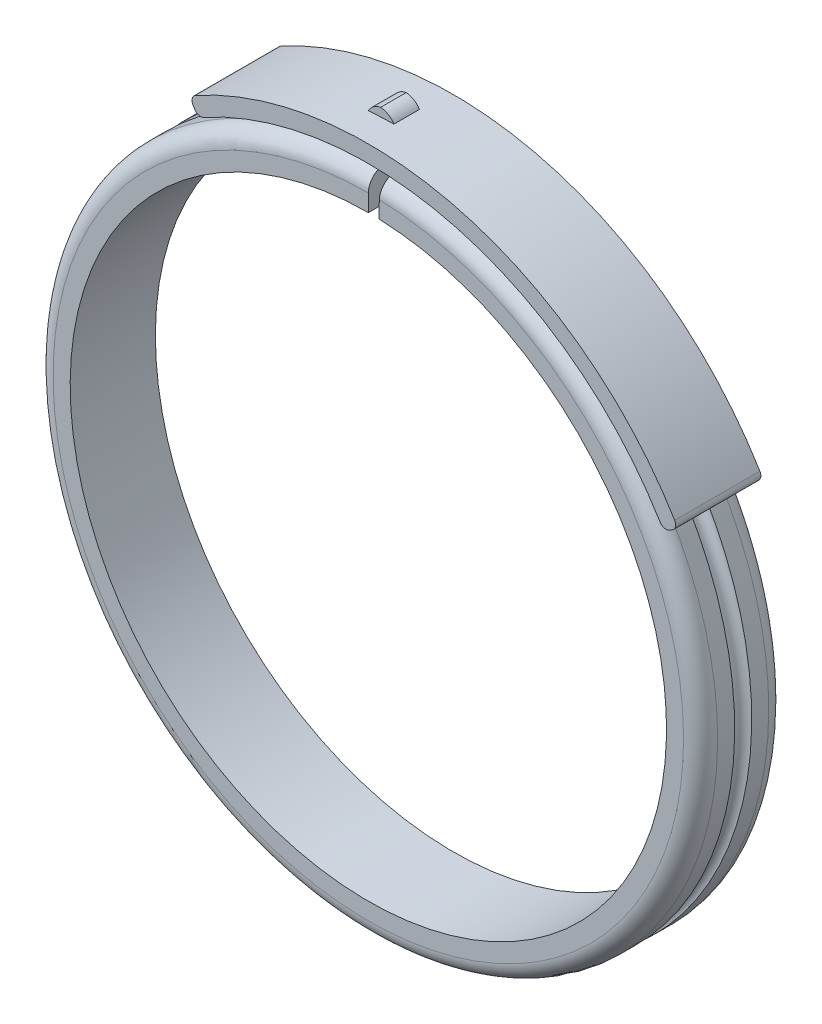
ISO-10303-21;
HEADER;
FILE_DESCRIPTION(('STEP AP214'),'2;1');
FILE_NAME('part.step','',(''),(''),'','','');
FILE_SCHEMA(('AUTOMOTIVE_DESIGN { 1 0 10303 214 1 1 1 1 }'));
ENDSEC;
DATA;
#1=APPLICATION_CONTEXT('core data for automotive mechanical design processes');
#2=APPLICATION_PROTOCOL_DEFINITION('international standard','automotive_design',2000,#1);
#3=PRODUCT_CONTEXT('',#1,'mechanical');
#4=PRODUCT('Part','Part','',(#3));
#5=PRODUCT_RELATED_PRODUCT_CATEGORY('part','',(#4));
#6=PRODUCT_DEFINITION_FORMATION('','',#4);
#7=PRODUCT_DEFINITION_CONTEXT('part definition',#1,'design');
#8=PRODUCT_DEFINITION('design','',#6,#7);
#9=PRODUCT_DEFINITION_SHAPE('','',#8);
#10=(LENGTH_UNIT() NAMED_UNIT(*) SI_UNIT(.MILLI.,.METRE.));
#11=(NAMED_UNIT(*) PLANE_ANGLE_UNIT() SI_UNIT($,.RADIAN.));
#12=(NAMED_UNIT(*) SI_UNIT($,.STERADIAN.) SOLID_ANGLE_UNIT());
#13=UNCERTAINTY_MEASURE_WITH_UNIT(LENGTH_MEASURE(1.E-05),#10,'distance_accuracy_value','');
#14=(GEOMETRIC_REPRESENTATION_CONTEXT(3) GLOBAL_UNCERTAINTY_ASSIGNED_CONTEXT((#13)) GLOBAL_UNIT_ASSIGNED_CONTEXT((#10,
#11,#12)) REPRESENTATION_CONTEXT('',''));
#15=CARTESIAN_POINT('',(0.,0.,0.));
#16=DIRECTION('',(0.,0.,1.));
#17=DIRECTION('',(1.,0.,0.));
#18=AXIS2_PLACEMENT_3D('',#15,#16,#17);
#19=CARTESIAN_POINT('',(0.,0.,10.));
#20=DIRECTION('',(0.,0.,-1.));
#21=DIRECTION('',(-1.,0.,0.));
#22=AXIS2_PLACEMENT_3D('',#19,#20,#21);
#23=CYLINDRICAL_SURFACE('',#22,39.);
#24=DIRECTION('',(0.,0.,-1.));
#25=VECTOR('',#24,1.);
#26=CARTESIAN_POINT('',(0.,39.,10.));
#27=LINE('',#26,#25);
#28=CARTESIAN_POINT('',(0.,39.,4.00000513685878));
#29=VERTEX_POINT('',#28);
#30=CARTESIAN_POINT('',(0.,39.,2.));
#31=VERTEX_POINT('',#30);
#32=EDGE_CURVE('E217',#29,#31,#27,.T.);
#33=ORIENTED_EDGE('',*,*,#32,.T.);
#34=CARTESIAN_POINT('',(0.,0.,2.));
#35=DIRECTION('',(0.,0.,1.));
#36=DIRECTION('',(1.,0.,0.));
#37=AXIS2_PLACEMENT_3D('',#34,#35,#36);
#38=CIRCLE('',#37,39.);
#39=CARTESIAN_POINT('',(1.36108037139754,38.9762422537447,2.));
#40=VERTEX_POINT('',#39);
#41=EDGE_CURVE('E210',#31,#40,#38,.T.);
#42=ORIENTED_EDGE('',*,*,#41,.T.);
#43=DIRECTION('',(0.,0.,-1.));
#44=VECTOR('',#43,1.);
#45=CARTESIAN_POINT('',(1.36108037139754,38.9762422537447,10.));
#46=LINE('',#45,#44);
#47=CARTESIAN_POINT('',(1.36108037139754,38.9762422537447,4.00000513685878));
#48=VERTEX_POINT('',#47);
#49=EDGE_CURVE('E243',#48,#40,#46,.T.);
#50=ORIENTED_EDGE('',*,*,#49,.F.);
#51=CARTESIAN_POINT('',(0.,0.,4.00000513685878));
#52=DIRECTION('',(0.,0.,1.));
#53=DIRECTION('',(1.,0.,0.));
#54=AXIS2_PLACEMENT_3D('',#51,#52,#53);
#55=CIRCLE('',#54,39.);
#56=CARTESIAN_POINT('',(-3.5,38.8426312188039,4.00000513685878));
#57=VERTEX_POINT('',#56);
#58=EDGE_CURVE('E223',#48,#57,#55,.F.);
#59=ORIENTED_EDGE('',*,*,#58,.T.);
#60=DIRECTION('',(0.,0.,-1.));
#61=VECTOR('',#60,1.);
#62=CARTESIAN_POINT('',(-3.5,38.8426312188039,10.));
#63=LINE('',#62,#61);
#64=CARTESIAN_POINT('',(-3.50000000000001,38.8426312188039,3.50000000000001));
#65=VERTEX_POINT('',#64);
#66=EDGE_CURVE('E255',#57,#65,#63,.T.);
#67=ORIENTED_EDGE('',*,*,#66,.T.);
#68=CARTESIAN_POINT('',(0.,0.,3.50000000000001));
#69=DIRECTION('',(0.,0.,1.));
#70=DIRECTION('',(1.,0.,0.));
#71=AXIS2_PLACEMENT_3D('',#68,#69,#70);
#72=CIRCLE('',#71,39.);
#73=CARTESIAN_POINT('',(-0.500000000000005,38.9967947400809,3.50000000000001));
#74=VERTEX_POINT('',#73);
#75=EDGE_CURVE('E247',#74,#65,#72,.T.);
#76=ORIENTED_EDGE('',*,*,#75,.F.);
#77=DIRECTION('',(0.,0.,-1.));
#78=VECTOR('',#77,1.);
#79=CARTESIAN_POINT('',(-0.500000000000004,38.9967947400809,10.));
#80=LINE('',#79,#78);
#81=CARTESIAN_POINT('',(-0.500000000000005,38.9967947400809,4.00000513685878));
#82=VERTEX_POINT('',#81);
#83=EDGE_CURVE('E220',#82,#74,#80,.T.);
#84=ORIENTED_EDGE('',*,*,#83,.F.);
#85=EDGE_CURVE('E205',#82,#29,#55,.F.);
#86=ORIENTED_EDGE('',*,*,#85,.T.);
#87=EDGE_LOOP('',(#33,#42,#50,#59,#67,#76,#84,#86));
#88=FACE_BOUND('',#87,.T.);
#89=ADVANCED_FACE('F34',(#88),#23,.T.);
#90=CARTESIAN_POINT('',(35.2735195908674,21.2889364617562,10.));
#91=DIRECTION('',(0.,0.,-1.));
#92=DIRECTION('',(-1.,0.,0.));
#93=AXIS2_PLACEMENT_3D('',#90,#91,#92);
#94=CYLINDRICAL_SURFACE('',#93,0.800000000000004);
#95=CARTESIAN_POINT('',(35.2735195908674,21.2889364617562,0.));
#96=DIRECTION('',(0.,0.,1.));
#97=DIRECTION('',(-1.,0.,0.));
#98=AXIS2_PLACEMENT_3D('',#95,#96,#97);
#99=CIRCLE('',#98,0.800000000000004);
#100=CARTESIAN_POINT('',(35.6735195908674,20.5961161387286,0.));
#101=VERTEX_POINT('',#100);
#102=CARTESIAN_POINT('',(35.9584423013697,21.7023138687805,0.));
#103=VERTEX_POINT('',#102);
#104=EDGE_CURVE('E282',#101,#103,#99,.T.);
#105=ORIENTED_EDGE('',*,*,#104,.T.);
#106=DIRECTION('',(0.,0.,-1.));
#107=VECTOR('',#106,1.);
#108=CARTESIAN_POINT('',(35.9584423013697,21.7023138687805,10.));
#109=LINE('',#108,#107);
#110=CARTESIAN_POINT('',(35.9584423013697,21.7023138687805,10.));
#111=VERTEX_POINT('',#110);
#112=EDGE_CURVE('E337',#111,#103,#109,.T.);
#113=ORIENTED_EDGE('',*,*,#112,.F.);
#114=CARTESIAN_POINT('',(35.2735195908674,21.2889364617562,10.));
#115=DIRECTION('',(0.,0.,1.));
#116=DIRECTION('',(-1.,0.,0.));
#117=AXIS2_PLACEMENT_3D('',#114,#115,#116);
#118=CIRCLE('',#117,0.800000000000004);
#119=CARTESIAN_POINT('',(35.6735195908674,20.5961161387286,10.));
#120=VERTEX_POINT('',#119);
#121=EDGE_CURVE('E283',#120,#111,#118,.T.);
#122=ORIENTED_EDGE('',*,*,#121,.F.);
#123=DIRECTION('',(0.,0.,-1.));
#124=VECTOR('',#123,1.);
#125=CARTESIAN_POINT('',(35.6735195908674,20.5961161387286,10.));
#126=LINE('',#125,#124);
#127=EDGE_CURVE('E301',#120,#101,#126,.T.);
#128=ORIENTED_EDGE('',*,*,#127,.T.);
#129=EDGE_LOOP('',(#105,#113,#122,#128));
#130=FACE_BOUND('',#129,.T.);
#131=ADVANCED_FACE('F444',(#130),#94,.T.);
#132=CARTESIAN_POINT('',(0.,0.,10.));
#133=DIRECTION('',(0.,0.,-1.));
#134=DIRECTION('',(-1.,0.,0.));
#135=AXIS2_PLACEMENT_3D('',#132,#133,#134);
#136=CYLINDRICAL_SURFACE('',#135,42.);
#137=CARTESIAN_POINT('',(0.,0.,3.50000000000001));
#138=DIRECTION('',(0.,0.,-1.));
#139=DIRECTION('',(-1.,0.,0.));
#140=AXIS2_PLACEMENT_3D('',#137,#138,#139);
#141=CIRCLE('',#140,42.);
#142=CARTESIAN_POINT('',(-3.5,41.8539126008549,3.50000000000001));
#143=VERTEX_POINT('',#142);
#144=CARTESIAN_POINT('',(-0.500000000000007,41.9970237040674,3.50000000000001));
#145=VERTEX_POINT('',#144);
#146=EDGE_CURVE('E274',#143,#145,#141,.T.);
#147=ORIENTED_EDGE('',*,*,#146,.T.);
#148=DIRECTION('',(0.,0.,-1.));
#149=VECTOR('',#148,1.);
#150=CARTESIAN_POINT('',(-0.500000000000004,41.9970237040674,10.));
#151=LINE('',#150,#149);
#152=CARTESIAN_POINT('',(-0.500000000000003,41.9970237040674,6.50000000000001));
#153=VERTEX_POINT('',#152);
#154=EDGE_CURVE('E280',#145,#153,#151,.F.);
#155=ORIENTED_EDGE('',*,*,#154,.T.);
#156=CARTESIAN_POINT('',(0.,0.,6.50000000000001));
#157=DIRECTION('',(0.,0.,1.));
#158=DIRECTION('',(1.,0.,0.));
#159=AXIS2_PLACEMENT_3D('',#156,#157,#158);
#160=CIRCLE('',#159,42.);
#161=CARTESIAN_POINT('',(-3.5,41.8539126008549,6.50000000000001));
#162=VERTEX_POINT('',#161);
#163=EDGE_CURVE('E277',#153,#162,#160,.T.);
#164=ORIENTED_EDGE('',*,*,#163,.T.);
#165=DIRECTION('',(0.,0.,-1.));
#166=VECTOR('',#165,1.);
#167=CARTESIAN_POINT('',(-3.5,41.8539126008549,10.));
#168=LINE('',#167,#166);
#169=EDGE_CURVE('E250',#143,#162,#168,.F.);
#170=ORIENTED_EDGE('',*,*,#169,.F.);
#171=EDGE_LOOP('',(#147,#155,#164,#170));
#172=FACE_BOUND('',#171,.T.);
#173=CARTESIAN_POINT('',(0.,0.,0.));
#174=DIRECTION('',(0.,0.,1.));
#175=DIRECTION('',(1.,0.,0.));
#176=AXIS2_PLACEMENT_3D('',#173,#174,#175);
#177=CIRCLE('',#176,42.);
#178=CARTESIAN_POINT('',(-20.2897675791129,36.7739762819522,0.));
#179=VERTEX_POINT('',#178);
#180=EDGE_CURVE('E304',#103,#179,#177,.T.);
#181=ORIENTED_EDGE('',*,*,#180,.T.);
#182=DIRECTION('',(0.,0.,-1.));
#183=VECTOR('',#182,1.);
#184=CARTESIAN_POINT('',(-20.2897675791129,36.7739762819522,10.));
#185=LINE('',#184,#183);
#186=CARTESIAN_POINT('',(-20.2897675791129,36.7739762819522,10.));
#187=VERTEX_POINT('',#186);
#188=EDGE_CURVE('E334',#187,#179,#185,.T.);
#189=ORIENTED_EDGE('',*,*,#188,.F.);
#190=CARTESIAN_POINT('',(0.,0.,10.));
#191=DIRECTION('',(0.,0.,1.));
#192=DIRECTION('',(1.,0.,0.));
#193=AXIS2_PLACEMENT_3D('',#190,#191,#192);
#194=CIRCLE('',#193,42.);
#195=EDGE_CURVE('E286',#111,#187,#194,.T.);
#196=ORIENTED_EDGE('',*,*,#195,.F.);
#197=ORIENTED_EDGE('',*,*,#112,.T.);
#198=EDGE_LOOP('',(#181,#189,#196,#197));
#199=FACE_BOUND('',#198,.T.);
#200=ADVANCED_FACE('F448',(#172,#199),#136,.T.);
#201=CARTESIAN_POINT('',(-19.9032958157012,36.0735195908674,10.));
#202=DIRECTION('',(0.,0.,-1.));
#203=DIRECTION('',(-1.,0.,0.));
#204=AXIS2_PLACEMENT_3D('',#201,#202,#203);
#205=CYLINDRICAL_SURFACE('',#204,0.799999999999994);
#206=CARTESIAN_POINT('',(-19.9032958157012,36.0735195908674,0.));
#207=DIRECTION('',(0.,0.,1.));
#208=DIRECTION('',(1.,0.,0.));
#209=AXIS2_PLACEMENT_3D('',#206,#207,#208);
#210=CIRCLE('',#209,0.799999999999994);
#211=CARTESIAN_POINT('',(-20.5961161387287,35.6735195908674,0.));
#212=VERTEX_POINT('',#211);
#213=EDGE_CURVE('E306',#179,#212,#210,.T.);
#214=ORIENTED_EDGE('',*,*,#213,.T.);
#215=DIRECTION('',(0.,0.,-1.));
#216=VECTOR('',#215,1.);
#217=CARTESIAN_POINT('',(-20.5961161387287,35.6735195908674,10.));
#218=LINE('',#217,#216);
#219=CARTESIAN_POINT('',(-20.5961161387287,35.6735195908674,10.));
#220=VERTEX_POINT('',#219);
#221=EDGE_CURVE('E331',#220,#212,#218,.T.);
#222=ORIENTED_EDGE('',*,*,#221,.F.);
#223=CARTESIAN_POINT('',(-19.9032958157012,36.0735195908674,10.));
#224=DIRECTION('',(0.,0.,1.));
#225=DIRECTION('',(1.,0.,0.));
#226=AXIS2_PLACEMENT_3D('',#223,#224,#225);
#227=CIRCLE('',#226,0.799999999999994);
#228=EDGE_CURVE('E289',#187,#220,#227,.T.);
#229=ORIENTED_EDGE('',*,*,#228,.F.);
#230=ORIENTED_EDGE('',*,*,#188,.T.);
#231=EDGE_LOOP('',(#214,#222,#229,#230));
#232=FACE_BOUND('',#231,.T.);
#233=ADVANCED_FACE('F454',(#232),#205,.T.);
#234=CARTESIAN_POINT('',(-20.3960780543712,35.3270434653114,10.));
#235=DIRECTION('',(0.866025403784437,0.500000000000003,0.));
#236=DIRECTION('',(-0.500000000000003,0.866025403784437,0.));
#237=AXIS2_PLACEMENT_3D('',#234,#235,#236);
#238=PLANE('',#237);
#239=DIRECTION('',(0.500000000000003,-0.866025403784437,0.));
#240=VECTOR('',#239,1.);
#241=CARTESIAN_POINT('',(-20.3960780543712,35.3270434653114,0.));
#242=LINE('',#241,#240);
#243=CARTESIAN_POINT('',(-20.3960780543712,35.3270434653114,0.));
#244=VERTEX_POINT('',#243);
#245=EDGE_CURVE('E308',#212,#244,#242,.T.);
#246=ORIENTED_EDGE('',*,*,#245,.T.);
#247=DIRECTION('',(0.,0.,-1.));
#248=VECTOR('',#247,1.);
#249=CARTESIAN_POINT('',(-20.3960780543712,35.3270434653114,10.));
#250=LINE('',#249,#248);
#251=CARTESIAN_POINT('',(-20.3960780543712,35.3270434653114,10.));
#252=VERTEX_POINT('',#251);
#253=EDGE_CURVE('E328',#252,#244,#250,.T.);
#254=ORIENTED_EDGE('',*,*,#253,.F.);
#255=DIRECTION('',(0.500000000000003,-0.866025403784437,0.));
#256=VECTOR('',#255,1.);
#257=CARTESIAN_POINT('',(-20.3960780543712,35.3270434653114,10.));
#258=LINE('',#257,#256);
#259=EDGE_CURVE('E291',#220,#252,#258,.T.);
#260=ORIENTED_EDGE('',*,*,#259,.F.);
#261=ORIENTED_EDGE('',*,*,#221,.T.);
#262=EDGE_LOOP('',(#246,#254,#260,#261));
#263=FACE_BOUND('',#262,.T.);
#264=ADVANCED_FACE('F647',(#263),#238,.F.);
#265=CARTESIAN_POINT('',(-19.7032577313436,35.7270434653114,10.));
#266=DIRECTION('',(0.,0.,-1.));
#267=DIRECTION('',(-1.,0.,0.));
#268=AXIS2_PLACEMENT_3D('',#265,#266,#267);
#269=CYLINDRICAL_SURFACE('',#268,0.800000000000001);
#270=CARTESIAN_POINT('',(-19.7032577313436,35.7270434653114,0.));
#271=DIRECTION('',(0.,0.,1.));
#272=DIRECTION('',(-1.,0.,0.));
#273=AXIS2_PLACEMENT_3D('',#270,#271,#272);
#274=CIRCLE('',#273,0.800000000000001);
#275=CARTESIAN_POINT('',(-19.3169193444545,35.0265132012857,0.));
#276=VERTEX_POINT('',#275);
#277=EDGE_CURVE('E310',#244,#276,#274,.T.);
#278=ORIENTED_EDGE('',*,*,#277,.T.);
#279=DIRECTION('',(0.,0.,-1.));
#280=VECTOR('',#279,1.);
#281=CARTESIAN_POINT('',(-19.3169193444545,35.0265132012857,10.));
#282=LINE('',#281,#280);
#283=CARTESIAN_POINT('',(-19.3169193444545,35.0265132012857,10.));
#284=VERTEX_POINT('',#283);
#285=EDGE_CURVE('E325',#284,#276,#282,.T.);
#286=ORIENTED_EDGE('',*,*,#285,.F.);
#287=CARTESIAN_POINT('',(-19.7032577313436,35.7270434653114,10.));
#288=DIRECTION('',(0.,0.,1.));
#289=DIRECTION('',(-1.,0.,0.));
#290=AXIS2_PLACEMENT_3D('',#287,#288,#289);
#291=CIRCLE('',#290,0.800000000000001);
#292=EDGE_CURVE('E293',#252,#284,#291,.T.);
#293=ORIENTED_EDGE('',*,*,#292,.F.);
#294=ORIENTED_EDGE('',*,*,#253,.T.);
#295=EDGE_LOOP('',(#278,#286,#293,#294));
#296=FACE_BOUND('',#295,.T.);
#297=ADVANCED_FACE('F601',(#296),#269,.T.);
#298=CARTESIAN_POINT('',(0.,0.,10.));
#299=DIRECTION('',(0.,0.,-1.));
#300=DIRECTION('',(-1.,0.,0.));
#301=AXIS2_PLACEMENT_3D('',#298,#299,#300);
#302=CYLINDRICAL_SURFACE('',#301,40.);
#303=CARTESIAN_POINT('',(0.,0.,6.50000000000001));
#304=DIRECTION('',(0.,0.,1.));
#305=DIRECTION('',(1.,0.,0.));
#306=AXIS2_PLACEMENT_3D('',#303,#304,#305);
#307=CIRCLE('',#306,40.);
#308=CARTESIAN_POINT('',(-3.5,39.8465807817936,6.50000000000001));
#309=VERTEX_POINT('',#308);
#310=CARTESIAN_POINT('',(-0.500000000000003,39.9968748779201,6.50000000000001));
#311=VERTEX_POINT('',#310);
#312=EDGE_CURVE('E345',#309,#311,#307,.F.);
#313=ORIENTED_EDGE('',*,*,#312,.T.);
#314=DIRECTION('',(0.,0.,-1.));
#315=VECTOR('',#314,1.);
#316=CARTESIAN_POINT('',(-0.500000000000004,39.9968748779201,10.));
#317=LINE('',#316,#315);
#318=CARTESIAN_POINT('',(-0.500000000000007,39.9968748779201,3.50000000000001));
#319=VERTEX_POINT('',#318);
#320=EDGE_CURVE('E347',#311,#319,#317,.T.);
#321=ORIENTED_EDGE('',*,*,#320,.T.);
#322=CARTESIAN_POINT('',(0.,0.,3.50000000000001));
#323=DIRECTION('',(0.,0.,-1.));
#324=DIRECTION('',(-1.,0.,0.));
#325=AXIS2_PLACEMENT_3D('',#322,#323,#324);
#326=CIRCLE('',#325,40.);
#327=CARTESIAN_POINT('',(-3.5,39.8465807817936,3.50000000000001));
#328=VERTEX_POINT('',#327);
#329=EDGE_CURVE('E343',#319,#328,#326,.F.);
#330=ORIENTED_EDGE('',*,*,#329,.T.);
#331=DIRECTION('',(0.,0.,-1.));
#332=VECTOR('',#331,1.);
#333=CARTESIAN_POINT('',(-3.5,39.8465807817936,10.));
#334=LINE('',#333,#332);
#335=EDGE_CURVE('E340',#309,#328,#334,.T.);
#336=ORIENTED_EDGE('',*,*,#335,.F.);
#337=EDGE_LOOP('',(#313,#321,#330,#336));
#338=FACE_BOUND('',#337,.T.);
#339=CARTESIAN_POINT('',(0.,0.,0.));
#340=DIRECTION('',(0.,0.,-1.));
#341=DIRECTION('',(1.,0.,0.));
#342=AXIS2_PLACEMENT_3D('',#339,#340,#341);
#343=CIRCLE('',#342,40.);
#344=CARTESIAN_POINT('',(34.2421994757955,20.6753905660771,0.));
#345=VERTEX_POINT('',#344);
#346=EDGE_CURVE('E312',#276,#345,#343,.T.);
#347=ORIENTED_EDGE('',*,*,#346,.T.);
#348=DIRECTION('',(0.,0.,-1.));
#349=VECTOR('',#348,1.);
#350=CARTESIAN_POINT('',(34.2421994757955,20.6753905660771,10.));
#351=LINE('',#350,#349);
#352=CARTESIAN_POINT('',(34.2421994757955,20.6753905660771,10.));
#353=VERTEX_POINT('',#352);
#354=EDGE_CURVE('E322',#353,#345,#351,.T.);
#355=ORIENTED_EDGE('',*,*,#354,.F.);
#356=CARTESIAN_POINT('',(0.,0.,10.));
#357=DIRECTION('',(0.,0.,-1.));
#358=DIRECTION('',(1.,0.,0.));
#359=AXIS2_PLACEMENT_3D('',#356,#357,#358);
#360=CIRCLE('',#359,40.);
#361=EDGE_CURVE('E295',#284,#353,#360,.T.);
#362=ORIENTED_EDGE('',*,*,#361,.F.);
#363=ORIENTED_EDGE('',*,*,#285,.T.);
#364=EDGE_LOOP('',(#347,#355,#362,#363));
#365=FACE_BOUND('',#364,.T.);
#366=ADVANCED_FACE('F595',(#338,#365),#302,.F.);
#367=CARTESIAN_POINT('',(34.9270434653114,21.0888983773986,10.));
#368=DIRECTION('',(0.,0.,-1.));
#369=DIRECTION('',(-1.,0.,0.));
#370=AXIS2_PLACEMENT_3D('',#367,#368,#369);
#371=CYLINDRICAL_SURFACE('',#370,0.800000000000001);
#372=CARTESIAN_POINT('',(34.9270434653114,21.0888983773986,0.));
#373=DIRECTION('',(0.,0.,1.));
#374=DIRECTION('',(1.,0.,0.));
#375=AXIS2_PLACEMENT_3D('',#372,#373,#374);
#376=CIRCLE('',#375,0.800000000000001);
#377=CARTESIAN_POINT('',(35.3270434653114,20.3960780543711,0.));
#378=VERTEX_POINT('',#377);
#379=EDGE_CURVE('E314',#345,#378,#376,.T.);
#380=ORIENTED_EDGE('',*,*,#379,.T.);
#381=DIRECTION('',(0.,0.,-1.));
#382=VECTOR('',#381,1.);
#383=CARTESIAN_POINT('',(35.3270434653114,20.3960780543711,10.));
#384=LINE('',#383,#382);
#385=CARTESIAN_POINT('',(35.3270434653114,20.3960780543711,10.));
#386=VERTEX_POINT('',#385);
#387=EDGE_CURVE('E319',#386,#378,#384,.T.);
#388=ORIENTED_EDGE('',*,*,#387,.F.);
#389=CARTESIAN_POINT('',(34.9270434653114,21.0888983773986,10.));
#390=DIRECTION('',(0.,0.,1.));
#391=DIRECTION('',(1.,0.,0.));
#392=AXIS2_PLACEMENT_3D('',#389,#390,#391);
#393=CIRCLE('',#392,0.800000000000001);
#394=EDGE_CURVE('E297',#353,#386,#393,.T.);
#395=ORIENTED_EDGE('',*,*,#394,.F.);
#396=ORIENTED_EDGE('',*,*,#354,.T.);
#397=EDGE_LOOP('',(#380,#388,#395,#396));
#398=FACE_BOUND('',#397,.T.);
#399=ADVANCED_FACE('F600',(#398),#371,.T.);
#400=CARTESIAN_POINT('',(35.3270434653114,20.3960780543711,10.));
#401=DIRECTION('',(-0.499999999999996,0.866025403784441,0.));
#402=DIRECTION('',(-0.866025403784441,-0.499999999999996,0.));
#403=AXIS2_PLACEMENT_3D('',#400,#401,#402);
#404=PLANE('',#403);
#405=DIRECTION('',(0.866025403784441,0.499999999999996,0.));
#406=VECTOR('',#405,1.);
#407=CARTESIAN_POINT('',(35.3270434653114,20.3960780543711,0.));
#408=LINE('',#407,#406);
#409=EDGE_CURVE('E287',#378,#101,#408,.T.);
#410=ORIENTED_EDGE('',*,*,#409,.T.);
#411=ORIENTED_EDGE('',*,*,#127,.F.);
#412=DIRECTION('',(0.866025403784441,0.499999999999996,0.));
#413=VECTOR('',#412,1.);
#414=CARTESIAN_POINT('',(35.3270434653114,20.3960780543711,10.));
#415=LINE('',#414,#413);
#416=EDGE_CURVE('E299',#386,#120,#415,.T.);
#417=ORIENTED_EDGE('',*,*,#416,.F.);
#418=ORIENTED_EDGE('',*,*,#387,.T.);
#419=EDGE_LOOP('',(#410,#411,#417,#418));
#420=FACE_BOUND('',#419,.T.);
#421=ADVANCED_FACE('F623',(#420),#404,.F.);
#422=CARTESIAN_POINT('',(35.2735195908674,21.2889364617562,10.));
#423=DIRECTION('',(0.,0.,-1.));
#424=DIRECTION('',(-1.,0.,0.));
#425=AXIS2_PLACEMENT_3D('',#422,#423,#424);
#426=PLANE('',#425);
#427=ORIENTED_EDGE('',*,*,#121,.T.);
#428=ORIENTED_EDGE('',*,*,#195,.T.);
#429=ORIENTED_EDGE('',*,*,#228,.T.);
#430=ORIENTED_EDGE('',*,*,#259,.T.);
#431=ORIENTED_EDGE('',*,*,#292,.T.);
#432=ORIENTED_EDGE('',*,*,#361,.T.);
#433=ORIENTED_EDGE('',*,*,#394,.T.);
#434=ORIENTED_EDGE('',*,*,#416,.T.);
#435=EDGE_LOOP('',(#427,#428,#429,#430,#431,#432,#433,#434));
#436=FACE_BOUND('',#435,.T.);
#437=ADVANCED_FACE('F613',(#436),#426,.F.);
#438=CARTESIAN_POINT('',(35.2735195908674,21.2889364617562,0.));
#439=DIRECTION('',(0.,0.,-1.));
#440=DIRECTION('',(-1.,0.,0.));
#441=AXIS2_PLACEMENT_3D('',#438,#439,#440);
#442=PLANE('',#441);
#443=ORIENTED_EDGE('',*,*,#104,.F.);
#444=ORIENTED_EDGE('',*,*,#409,.F.);
#445=ORIENTED_EDGE('',*,*,#379,.F.);
#446=ORIENTED_EDGE('',*,*,#346,.F.);
#447=ORIENTED_EDGE('',*,*,#277,.F.);
#448=ORIENTED_EDGE('',*,*,#245,.F.);
#449=ORIENTED_EDGE('',*,*,#213,.F.);
#450=ORIENTED_EDGE('',*,*,#180,.F.);
#451=EDGE_LOOP('',(#443,#444,#445,#446,#447,#448,#449,#450));
#452=FACE_BOUND('',#451,.T.);
#453=ADVANCED_FACE('F538',(#452),#442,.T.);
#454=CARTESIAN_POINT('',(-3.5,38.8426312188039,10.));
#455=DIRECTION('',(1.,0.,0.));
#456=DIRECTION('',(0.,0.,-1.));
#457=AXIS2_PLACEMENT_3D('',#454,#455,#456);
#458=PLANE('',#457);
#459=ORIENTED_EDGE('',*,*,#66,.F.);
#460=CARTESIAN_POINT('',(-3.5,39.1600785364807,4.05237393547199));
#461=CARTESIAN_POINT('',(-3.5,39.2135485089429,4.0703261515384));
#462=CARTESIAN_POINT('',(-3.5,39.2655446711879,4.0927950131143));
#463=CARTESIAN_POINT('',(-3.5,39.3650747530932,4.14615448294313));
#464=CARTESIAN_POINT('',(-3.5,39.4126033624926,4.17705494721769));
#465=CARTESIAN_POINT('',(-3.5,39.5017810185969,4.24639771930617));
#466=CARTESIAN_POINT('',(-3.5,39.5434319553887,4.28483759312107));
#467=CARTESIAN_POINT('',(-3.5,39.6196556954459,4.36817204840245));
#468=CARTESIAN_POINT('',(-3.5,39.6542302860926,4.41306499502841));
#469=CARTESIAN_POINT('',(-3.5,39.715232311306,4.50791459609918));
#470=CARTESIAN_POINT('',(-3.5,39.7416809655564,4.55785760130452));
#471=CARTESIAN_POINT('',(-3.5,39.7857856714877,4.66148803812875));
#472=CARTESIAN_POINT('',(-3.5,39.8034415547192,4.71517554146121));
#473=CARTESIAN_POINT('',(-3.5,39.8293989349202,4.82456944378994));
#474=CARTESIAN_POINT('',(-3.5,39.8377326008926,4.88026821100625));
#475=CARTESIAN_POINT('',(-3.5,39.8449125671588,4.99227351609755));
#476=CARTESIAN_POINT('',(-3.5,39.8437590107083,5.04858004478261));
#477=CARTESIAN_POINT('',(-3.5,39.8320086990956,5.16009975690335));
#478=CARTESIAN_POINT('',(-3.5,39.8214282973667,5.21531466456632));
#479=CARTESIAN_POINT('',(-3.5,39.7911537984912,5.32318609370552));
#480=CARTESIAN_POINT('',(-3.5,39.7714597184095,5.37584261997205));
#481=CARTESIAN_POINT('',(-3.5,39.7235105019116,5.47714445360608));
#482=CARTESIAN_POINT('',(-3.5,39.6952496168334,5.52578703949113));
#483=CARTESIAN_POINT('',(-3.5,39.6309840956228,5.617654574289));
#484=CARTESIAN_POINT('',(-3.5,39.5949793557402,5.66087945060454));
#485=CARTESIAN_POINT('',(-3.5,39.5161437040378,5.7408171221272));
#486=CARTESIAN_POINT('',(-3.5,39.4732939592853,5.77751134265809));
#487=CARTESIAN_POINT('',(-3.5,39.3820620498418,5.84321756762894));
#488=CARTESIAN_POINT('',(-3.5,39.3336797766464,5.87222942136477));
#489=CARTESIAN_POINT('',(-3.5,39.2325596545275,5.92186360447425));
#490=CARTESIAN_POINT('',(-3.5,39.1798059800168,5.9424536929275));
#491=CARTESIAN_POINT('',(-3.5,39.0715971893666,5.97451709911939));
#492=CARTESIAN_POINT('',(-3.5,39.0161420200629,5.98599023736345));
#493=CARTESIAN_POINT('',(-3.5,38.9039138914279,5.99952618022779));
#494=CARTESIAN_POINT('',(-3.5,38.8471372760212,6.00155868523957));
#495=CARTESIAN_POINT('',(-3.5,38.734046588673,5.99607564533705));
#496=CARTESIAN_POINT('',(-3.5,38.677732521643,5.9885599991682));
#497=CARTESIAN_POINT('',(-3.5,38.5670952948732,5.96417432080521));
#498=CARTESIAN_POINT('',(-3.5,38.5127746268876,5.94729297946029));
#499=CARTESIAN_POINT('',(-3.5,38.4077441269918,5.90463776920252));
#500=CARTESIAN_POINT('',(-3.5,38.3570342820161,5.87886393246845));
#501=CARTESIAN_POINT('',(-3.5,38.26074645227,5.81918681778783));
#502=CARTESIAN_POINT('',(-3.5,38.2151613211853,5.78529507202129));
#503=CARTESIAN_POINT('',(-3.5,38.1303532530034,5.71031475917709));
#504=CARTESIAN_POINT('',(-3.5,38.0911302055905,5.66922631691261));
#505=CARTESIAN_POINT('',(-3.5,38.0203093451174,5.58117097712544));
#506=CARTESIAN_POINT('',(-3.5,37.9886852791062,5.53422519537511));
#507=CARTESIAN_POINT('',(-3.5,37.933805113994,5.43567355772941));
#508=CARTESIAN_POINT('',(-3.5,37.9105488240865,5.38406780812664));
#509=CARTESIAN_POINT('',(-3.5,37.8731611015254,5.27788601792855));
#510=CARTESIAN_POINT('',(-3.5,37.8589930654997,5.22332286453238));
#511=CARTESIAN_POINT('',(-3.5,37.840046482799,5.11259026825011));
#512=CARTESIAN_POINT('',(-3.5,37.8352677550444,5.05642085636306));
#513=CARTESIAN_POINT('',(-3.5,37.8352394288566,4.9442332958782));
#514=CARTESIAN_POINT('',(-3.5,37.8399639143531,4.88821515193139));
#515=CARTESIAN_POINT('',(-3.5,37.8587521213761,4.77776796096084));
#516=CARTESIAN_POINT('',(-3.5,37.8728158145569,4.72333890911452));
#517=CARTESIAN_POINT('',(-3.5,37.9098715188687,4.61761760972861));
#518=CARTESIAN_POINT('',(-3.5,37.9328625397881,4.56632501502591));
#519=CARTESIAN_POINT('',(-3.5,37.9871085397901,4.46831415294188));
#520=CARTESIAN_POINT('',(-3.5,38.0183636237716,4.42159594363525));
#521=CARTESIAN_POINT('',(-3.5,38.0883311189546,4.3339279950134));
#522=CARTESIAN_POINT('',(-3.5,38.1270624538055,4.29299336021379));
#523=CARTESIAN_POINT('',(-3.5,38.2108219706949,4.21817740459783));
#524=CARTESIAN_POINT('',(-3.5,38.2558500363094,4.18429595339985));
#525=CARTESIAN_POINT('',(-3.5,38.3511130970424,4.12440479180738));
#526=CARTESIAN_POINT('',(-3.5,38.4013676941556,4.09842626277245));
#527=CARTESIAN_POINT('',(-3.5,38.5055278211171,4.05523381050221));
#528=CARTESIAN_POINT('',(-3.5,38.5594343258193,4.03802223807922));
#529=CARTESIAN_POINT('',(-3.5,38.6695855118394,4.01279492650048));
#530=CARTESIAN_POINT('',(-3.5,38.7258388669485,4.00481714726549));
#531=CARTESIAN_POINT('',(-3.5,38.8388405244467,3.99841654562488));
#532=CARTESIAN_POINT('',(-3.5,38.8955881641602,3.9999824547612));
#533=CARTESIAN_POINT('',(-3.5,38.9871788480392,4.01025081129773));
#534=CARTESIAN_POINT('',(-3.5,39.0223660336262,4.01610175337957));
#535=CARTESIAN_POINT('',(-3.5,39.0919244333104,4.03149211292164));
#536=CARTESIAN_POINT('',(-3.5,39.1262956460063,4.04103153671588));
#537=CARTESIAN_POINT('',(-3.5,39.1600785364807,4.05237393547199));
#538=B_SPLINE_CURVE_WITH_KNOTS('',3,(#460,#461,#462,#463,#464,#465,#466,#467,#468,#469,#470,
#471,#472,#473,#474,#475,#476,#477,#478,#479,#480,#481,#482,#483,#484,#485,#486,#487,#488,#489,
#490,#491,#492,#493,#494,#495,#496,#497,#498,#499,#500,#501,#502,#503,#504,#505,#506,#507,#508,
#509,#510,#511,#512,#513,#514,#515,#516,#517,#518,#519,#520,#521,#522,#523,#524,#525,#526,#527,
#528,#529,#530,#531,#532,#533,#534,#535,#536,#537),.UNSPECIFIED.,.T.,.F.,(4,2,2,2,2,2,2,2,2,2,2,
2,2,2,2,2,2,2,2,2,2,2,2,2,2,2,2,2,2,2,2,2,2,2,2,2,2,2,4),(0.,0.169080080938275,
0.338358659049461,0.507582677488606,0.676763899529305,0.845499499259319,1.01423833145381,
1.18239306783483,1.35054526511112,1.51840632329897,1.68626706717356,1.85424070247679,
2.02221658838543,2.1906628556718,2.35911242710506,2.52820096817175,2.69729283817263,
2.8669270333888,3.036563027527,3.20640430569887,3.3762449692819,3.54584577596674,
3.71544364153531,3.88444687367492,4.0534462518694,4.22176063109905,4.39007176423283,
4.55792452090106,4.72577676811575,4.89361040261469,5.06144616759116,5.22971245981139,
5.3979756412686,5.56689435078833,5.73585833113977,5.90551447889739,6.07497034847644,
6.18179673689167,6.2886233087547),.UNSPECIFIED.);
#539=CARTESIAN_POINT('',(-3.5,38.8426312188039,5.99999486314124));
#540=VERTEX_POINT('',#539);
#541=EDGE_CURVE('E359',#57,#540,#538,.T.);
#542=ORIENTED_EDGE('',*,*,#541,.T.);
#543=CARTESIAN_POINT('',(-3.5,38.8426312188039,6.50000000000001));
#544=VERTEX_POINT('',#543);
#545=EDGE_CURVE('E252',#544,#540,#63,.T.);
#546=ORIENTED_EDGE('',*,*,#545,.F.);
#547=DIRECTION('',(0.,1.,0.));
#548=VECTOR('',#547,1.);
#549=CARTESIAN_POINT('',(-3.5,38.8426312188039,6.50000000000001));
#550=LINE('',#549,#548);
#551=EDGE_CURVE('E259',#544,#309,#550,.T.);
#552=ORIENTED_EDGE('',*,*,#551,.T.);
#553=ORIENTED_EDGE('',*,*,#335,.T.);
#554=DIRECTION('',(0.,1.,0.));
#555=VECTOR('',#554,1.);
#556=CARTESIAN_POINT('',(-3.5,38.8426312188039,3.50000000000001));
#557=LINE('',#556,#555);
#558=EDGE_CURVE('E251',#65,#328,#557,.T.);
#559=ORIENTED_EDGE('',*,*,#558,.F.);
#560=EDGE_LOOP('',(#459,#542,#546,#552,#553,#559));
#561=FACE_BOUND('',#560,.T.);
#562=ADVANCED_FACE('F534',(#561),#458,.F.);
#563=CARTESIAN_POINT('',(-3.5,38.8426312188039,3.50000000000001));
#564=DIRECTION('',(0.,0.,-1.));
#565=DIRECTION('',(-1.,0.,0.));
#566=AXIS2_PLACEMENT_3D('',#563,#564,#565);
#567=PLANE('',#566);
#568=ORIENTED_EDGE('',*,*,#329,.F.);
#569=DIRECTION('',(0.,1.,0.));
#570=VECTOR('',#569,1.);
#571=CARTESIAN_POINT('',(-0.500000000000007,38.9967947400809,3.50000000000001));
#572=LINE('',#571,#570);
#573=EDGE_CURVE('E263',#74,#319,#572,.T.);
#574=ORIENTED_EDGE('',*,*,#573,.F.);
#575=ORIENTED_EDGE('',*,*,#75,.T.);
#576=ORIENTED_EDGE('',*,*,#558,.T.);
#577=EDGE_LOOP('',(#568,#574,#575,#576));
#578=FACE_BOUND('',#577,.T.);
#579=ADVANCED_FACE('F442',(#578),#567,.T.);
#580=CARTESIAN_POINT('',(-0.500000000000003,38.9967947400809,6.50000000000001));
#581=DIRECTION('',(0.,0.,1.));
#582=DIRECTION('',(1.,0.,0.));
#583=AXIS2_PLACEMENT_3D('',#580,#581,#582);
#584=PLANE('',#583);
#585=ORIENTED_EDGE('',*,*,#312,.F.);
#586=ORIENTED_EDGE('',*,*,#551,.F.);
#587=CARTESIAN_POINT('',(0.,0.,6.50000000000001));
#588=DIRECTION('',(0.,0.,-1.));
#589=DIRECTION('',(-1.,0.,0.));
#590=AXIS2_PLACEMENT_3D('',#587,#588,#589);
#591=CIRCLE('',#590,39.);
#592=CARTESIAN_POINT('',(-0.500000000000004,38.9967947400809,6.50000000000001));
#593=VERTEX_POINT('',#592);
#594=EDGE_CURVE('E256',#544,#593,#591,.T.);
#595=ORIENTED_EDGE('',*,*,#594,.T.);
#596=DIRECTION('',(0.,1.,0.));
#597=VECTOR('',#596,1.);
#598=CARTESIAN_POINT('',(-0.500000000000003,38.9967947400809,6.50000000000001));
#599=LINE('',#598,#597);
#600=EDGE_CURVE('E246',#593,#311,#599,.T.);
#601=ORIENTED_EDGE('',*,*,#600,.T.);
#602=EDGE_LOOP('',(#585,#586,#595,#601));
#603=FACE_BOUND('',#602,.T.);
#604=ADVANCED_FACE('F525',(#603),#584,.T.);
#605=CARTESIAN_POINT('',(-0.500000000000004,38.9967947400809,10.));
#606=DIRECTION('',(1.,0.,0.));
#607=DIRECTION('',(0.,0.,-1.));
#608=AXIS2_PLACEMENT_3D('',#605,#606,#607);
#609=PLANE('',#608);
#610=CARTESIAN_POINT('',(-0.500000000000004,39.3134523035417,4.0525274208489));
#611=CARTESIAN_POINT('',(-0.500000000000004,39.3666763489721,4.07049536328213));
#612=CARTESIAN_POINT('',(-0.500000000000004,39.418421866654,4.09297090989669));
#613=CARTESIAN_POINT('',(-0.500000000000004,39.5174476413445,4.14631007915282));
#614=CARTESIAN_POINT('',(-0.500000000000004,39.5647224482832,4.1771837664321));
#615=CARTESIAN_POINT('',(-0.500000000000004,39.6533981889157,4.24641954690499));
#616=CARTESIAN_POINT('',(-0.500000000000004,39.6948018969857,4.2847780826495));
#617=CARTESIAN_POINT('',(-0.500000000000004,39.7705695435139,4.36789198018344));
#618=CARTESIAN_POINT('',(-0.500000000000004,39.8049352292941,4.41264574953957));
#619=CARTESIAN_POINT('',(-0.500000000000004,39.8656674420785,4.50728996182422));
#620=CARTESIAN_POINT('',(-0.500000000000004,39.8920335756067,4.55718065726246));
#621=CARTESIAN_POINT('',(-0.500000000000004,39.9360159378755,4.66068257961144));
#622=CARTESIAN_POINT('',(-0.500000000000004,39.9536318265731,4.714293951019));
#623=CARTESIAN_POINT('',(-0.500000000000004,39.9796107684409,4.8237085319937));
#624=CARTESIAN_POINT('',(-0.500000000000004,39.9879746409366,4.87951154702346));
#625=CARTESIAN_POINT('',(-0.500000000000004,39.9952147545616,4.99172958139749));
#626=CARTESIAN_POINT('',(-0.500000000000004,39.9940910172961,5.04814459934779));
#627=CARTESIAN_POINT('',(-0.500000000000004,39.982388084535,5.15998330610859));
#628=CARTESIAN_POINT('',(-0.500000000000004,39.9718092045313,5.21540702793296));
#629=CARTESIAN_POINT('',(-0.500000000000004,39.9414968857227,5.32369170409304));
#630=CARTESIAN_POINT('',(-0.500000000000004,39.9217634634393,5.37655266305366));
#631=CARTESIAN_POINT('',(-0.500000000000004,39.8737021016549,5.47821222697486));
#632=CARTESIAN_POINT('',(-0.500000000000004,39.8453740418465,5.52701077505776));
#633=CARTESIAN_POINT('',(-0.500000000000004,39.7809278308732,5.61915977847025));
#634=CARTESIAN_POINT('',(-0.500000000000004,39.7448096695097,5.66251022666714));
#635=CARTESIAN_POINT('',(-0.500000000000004,39.665806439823,5.7425350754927));
#636=CARTESIAN_POINT('',(-0.500000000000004,39.6229209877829,5.77920909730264));
#637=CARTESIAN_POINT('',(-0.500000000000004,39.5316021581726,5.84483740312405));
#638=CARTESIAN_POINT('',(-0.500000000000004,39.4831687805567,5.87379168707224));
#639=CARTESIAN_POINT('',(-0.500000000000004,39.3821249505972,5.92316097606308));
#640=CARTESIAN_POINT('',(-0.500000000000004,39.3295141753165,5.94357532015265));
#641=CARTESIAN_POINT('',(-0.500000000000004,39.2216122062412,5.97528231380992));
#642=CARTESIAN_POINT('',(-0.500000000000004,39.166321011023,5.98657495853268));
#643=CARTESIAN_POINT('',(-0.500000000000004,39.0546239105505,5.99971862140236));
#644=CARTESIAN_POINT('',(-0.500000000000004,38.9982179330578,6.00156902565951));
#645=CARTESIAN_POINT('',(-0.500000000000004,38.8858958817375,5.99577406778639));
#646=CARTESIAN_POINT('',(-0.500000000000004,38.8299798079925,5.98812870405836));
#647=CARTESIAN_POINT('',(-0.500000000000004,38.7202234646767,5.96355884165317));
#648=CARTESIAN_POINT('',(-0.500000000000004,38.6663832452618,5.94663411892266));
#649=CARTESIAN_POINT('',(-0.500000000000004,38.562308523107,5.90398563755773));
#650=CARTESIAN_POINT('',(-0.500000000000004,38.5120740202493,5.8782618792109));
#651=CARTESIAN_POINT('',(-0.500000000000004,38.4166384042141,5.81874619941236));
#652=CARTESIAN_POINT('',(-0.500000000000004,38.3714371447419,5.78495451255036));
#653=CARTESIAN_POINT('',(-0.500000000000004,38.2873498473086,5.71026162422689));
#654=CARTESIAN_POINT('',(-0.500000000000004,38.2484638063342,5.66936042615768));
#655=CARTESIAN_POINT('',(-0.500000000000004,38.1781138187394,5.58161266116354));
#656=CARTESIAN_POINT('',(-0.500000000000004,38.1466493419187,5.5347665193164));
#657=CARTESIAN_POINT('',(-0.500000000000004,38.0920325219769,5.43645634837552));
#658=CARTESIAN_POINT('',(-0.500000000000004,38.0688801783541,5.38499231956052));
#659=CARTESIAN_POINT('',(-0.500000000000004,38.0315468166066,5.27891183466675));
#660=CARTESIAN_POINT('',(-0.500000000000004,38.0173650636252,5.22429563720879));
#661=CARTESIAN_POINT('',(-0.500000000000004,37.9983727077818,5.11345753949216));
#662=CARTESIAN_POINT('',(-0.500000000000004,37.9935620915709,5.05723564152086));
#663=CARTESIAN_POINT('',(-0.500000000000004,37.9934486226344,4.9447853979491));
#664=CARTESIAN_POINT('',(-0.500000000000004,37.9981452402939,4.88855705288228));
#665=CARTESIAN_POINT('',(-0.500000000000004,38.0169117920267,4.77768685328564));
#666=CARTESIAN_POINT('',(-0.500000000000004,38.0309817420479,4.72304500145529));
#667=CARTESIAN_POINT('',(-0.500000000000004,38.0680952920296,4.6168991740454));
#668=CARTESIAN_POINT('',(-0.500000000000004,38.09113885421,4.56539518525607));
#669=CARTESIAN_POINT('',(-0.500000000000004,38.1455453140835,4.46698653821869));
#670=CARTESIAN_POINT('',(-0.500000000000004,38.1769082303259,4.42008189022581));
#671=CARTESIAN_POINT('',(-0.500000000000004,38.2470653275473,4.3322000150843));
#672=CARTESIAN_POINT('',(-0.500000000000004,38.2858600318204,4.2912232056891));
#673=CARTESIAN_POINT('',(-0.500000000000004,38.3697763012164,4.21636526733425));
#674=CARTESIAN_POINT('',(-0.500000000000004,38.4148976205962,4.18248386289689));
#675=CARTESIAN_POINT('',(-0.500000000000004,38.510185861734,4.12277653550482));
#676=CARTESIAN_POINT('',(-0.500000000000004,38.5603526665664,4.09695042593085));
#677=CARTESIAN_POINT('',(-0.500000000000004,38.664323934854,4.05408027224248));
#678=CARTESIAN_POINT('',(-0.500000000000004,38.7181293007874,4.03703841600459));
#679=CARTESIAN_POINT('',(-0.500000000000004,38.8278621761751,4.01222165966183));
#680=CARTESIAN_POINT('',(-0.500000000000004,38.883790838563,4.00445187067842));
#681=CARTESIAN_POINT('',(-0.500000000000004,38.9961119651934,3.99842673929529));
#682=CARTESIAN_POINT('',(-0.500000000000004,39.0525037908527,4.00015996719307));
#683=CARTESIAN_POINT('',(-0.500000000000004,39.1431913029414,4.01062714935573));
#684=CARTESIAN_POINT('',(-0.500000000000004,39.1778432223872,4.01649221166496));
#685=CARTESIAN_POINT('',(-0.500000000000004,39.2463400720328,4.03182698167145));
#686=CARTESIAN_POINT('',(-0.500000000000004,39.2801850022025,4.04129668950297));
#687=CARTESIAN_POINT('',(-0.500000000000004,39.3134523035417,4.0525274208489));
#688=B_SPLINE_CURVE_WITH_KNOTS('',3,(#610,#611,#612,#613,#614,#615,#616,#617,#618,#619,#620,
#621,#622,#623,#624,#625,#626,#627,#628,#629,#630,#631,#632,#633,#634,#635,#636,#637,#638,#639,
#640,#641,#642,#643,#644,#645,#646,#647,#648,#649,#650,#651,#652,#653,#654,#655,#656,#657,#658,
#659,#660,#661,#662,#663,#664,#665,#666,#667,#668,#669,#670,#671,#672,#673,#674,#675,#676,#677,
#678,#679,#680,#681,#682,#683,#684,#685,#686,#687),.UNSPECIFIED.,.T.,.F.,(4,2,2,2,2,2,2,2,2,2,2,
2,2,2,2,2,2,2,2,2,2,2,2,2,2,2,2,2,2,2,2,2,2,2,2,2,2,2,4),(0.,0.168397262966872,
0.336997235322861,0.505517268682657,0.673995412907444,0.842481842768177,1.0109748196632,
1.17945287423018,1.34793054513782,1.51640259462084,1.6848743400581,1.85334844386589,
2.02182276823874,2.19030664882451,2.35879053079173,2.52728745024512,2.6957844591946,
2.86429242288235,3.03280041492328,3.20131247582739,3.36982453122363,3.53833168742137,
3.70683876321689,3.87533379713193,4.04382882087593,4.21231003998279,4.38079101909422,
4.54926261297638,4.71773449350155,4.88620566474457,5.0546772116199,5.22316062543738,
5.3916374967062,5.56011046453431,5.7286253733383,5.89723313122,6.06563814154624,
6.17089361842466,6.27614909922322),.UNSPECIFIED.);
#689=CARTESIAN_POINT('',(-0.500000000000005,38.9967947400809,5.99999486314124));
#690=VERTEX_POINT('',#689);
#691=EDGE_CURVE('E221',#82,#690,#688,.T.);
#692=ORIENTED_EDGE('',*,*,#691,.F.);
#693=ORIENTED_EDGE('',*,*,#83,.T.);
#694=ORIENTED_EDGE('',*,*,#573,.T.);
#695=ORIENTED_EDGE('',*,*,#320,.F.);
#696=ORIENTED_EDGE('',*,*,#600,.F.);
#697=EDGE_CURVE('E260',#593,#690,#80,.T.);
#698=ORIENTED_EDGE('',*,*,#697,.T.);
#699=EDGE_LOOP('',(#692,#693,#694,#695,#696,#698));
#700=FACE_BOUND('',#699,.T.);
#701=ADVANCED_FACE('F414',(#700),#609,.T.);
#702=CARTESIAN_POINT('',(-2.1946383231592,40.9348556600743,6.50000000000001));
#703=DIRECTION('',(0.,0.,1.));
#704=DIRECTION('',(1.,0.,0.));
#705=AXIS2_PLACEMENT_3D('',#702,#703,#704);
#706=CIRCLE('',#705,2.);
#707=CARTESIAN_POINT('',(-2.05742884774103,42.9301434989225,6.50000000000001));
#708=VERTEX_POINT('',#707);
#709=EDGE_CURVE('E353',#153,#708,#706,.T.);
#710=ORIENTED_EDGE('',*,*,#709,.T.);
#711=CARTESIAN_POINT('',(-1.71067218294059,40.9604329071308,6.50000000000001));
#712=DIRECTION('',(0.,0.,1.));
#713=DIRECTION('',(1.,0.,0.));
#714=AXIS2_PLACEMENT_3D('',#711,#712,#713);
#715=CIRCLE('',#714,2.);
#716=EDGE_CURVE('E211',#708,#162,#715,.T.);
#717=ORIENTED_EDGE('',*,*,#716,.T.);
#718=ORIENTED_EDGE('',*,*,#163,.F.);
#719=EDGE_LOOP('',(#710,#717,#718));
#720=FACE_BOUND('',#719,.T.);
#721=ADVANCED_FACE('F439',(#720),#584,.T.);
#722=ORIENTED_EDGE('',*,*,#146,.F.);
#723=CARTESIAN_POINT('',(-1.71067218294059,40.9604329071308,3.50000000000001));
#724=DIRECTION('',(0.,0.,-1.));
#725=DIRECTION('',(-1.,0.,0.));
#726=AXIS2_PLACEMENT_3D('',#723,#724,#725);
#727=CIRCLE('',#726,2.);
#728=CARTESIAN_POINT('',(-2.05742884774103,42.9301434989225,3.50000000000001));
#729=VERTEX_POINT('',#728);
#730=EDGE_CURVE('E351',#143,#729,#727,.T.);
#731=ORIENTED_EDGE('',*,*,#730,.T.);
#732=CARTESIAN_POINT('',(-2.1946383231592,40.9348556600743,3.50000000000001));
#733=DIRECTION('',(0.,0.,-1.));
#734=DIRECTION('',(-1.,0.,0.));
#735=AXIS2_PLACEMENT_3D('',#732,#733,#734);
#736=CIRCLE('',#735,2.);
#737=EDGE_CURVE('E349',#729,#145,#736,.T.);
#738=ORIENTED_EDGE('',*,*,#737,.T.);
#739=EDGE_LOOP('',(#722,#731,#738));
#740=FACE_BOUND('',#739,.T.);
#741=ADVANCED_FACE('F435',(#740),#567,.T.);
#742=CARTESIAN_POINT('',(1.36108037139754,38.9762422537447,8.));
#743=VERTEX_POINT('',#742);
#744=CARTESIAN_POINT('',(1.36108037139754,38.9762422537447,5.99999486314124));
#745=VERTEX_POINT('',#744);
#746=EDGE_CURVE('E244',#743,#745,#46,.T.);
#747=ORIENTED_EDGE('',*,*,#746,.F.);
#748=CARTESIAN_POINT('',(0.,0.,8.));
#749=DIRECTION('',(0.,0.,1.));
#750=DIRECTION('',(1.,0.,0.));
#751=AXIS2_PLACEMENT_3D('',#748,#749,#750);
#752=CIRCLE('',#751,39.);
#753=CARTESIAN_POINT('',(0.,39.,8.));
#754=VERTEX_POINT('',#753);
#755=EDGE_CURVE('E11',#743,#754,#752,.F.);
#756=ORIENTED_EDGE('',*,*,#755,.T.);
#757=CARTESIAN_POINT('',(0.,39.,5.99999486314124));
#758=VERTEX_POINT('',#757);
#759=EDGE_CURVE('E228',#754,#758,#27,.T.);
#760=ORIENTED_EDGE('',*,*,#759,.T.);
#761=CARTESIAN_POINT('',(0.,0.,5.99999486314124));
#762=DIRECTION('',(0.,0.,-1.));
#763=DIRECTION('',(-1.,0.,0.));
#764=AXIS2_PLACEMENT_3D('',#761,#762,#763);
#765=CIRCLE('',#764,39.);
#766=EDGE_CURVE('E208',#758,#690,#765,.F.);
#767=ORIENTED_EDGE('',*,*,#766,.T.);
#768=ORIENTED_EDGE('',*,*,#697,.F.);
#769=ORIENTED_EDGE('',*,*,#594,.F.);
#770=ORIENTED_EDGE('',*,*,#545,.T.);
#771=EDGE_CURVE('E408',#540,#745,#765,.F.);
#772=ORIENTED_EDGE('',*,*,#771,.T.);
#773=EDGE_LOOP('',(#747,#756,#760,#767,#768,#769,#770,#772));
#774=FACE_BOUND('',#773,.T.);
#775=ADVANCED_FACE('F433',(#774),#23,.T.);
#776=CARTESIAN_POINT('',(1.22148238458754,34.9786789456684,10.));
#777=DIRECTION('',(0.999390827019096,-0.0348994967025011,0.));
#778=DIRECTION('',(0.0348994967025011,0.999390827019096,0.));
#779=AXIS2_PLACEMENT_3D('',#776,#777,#778);
#780=PLANE('',#779);
#781=ORIENTED_EDGE('',*,*,#49,.T.);
#782=CARTESIAN_POINT('',(1.29128137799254,36.9774605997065,2.));
#783=DIRECTION('',(0.999390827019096,-0.0348994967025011,0.));
#784=DIRECTION('',(0.0348994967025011,0.999390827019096,0.));
#785=AXIS2_PLACEMENT_3D('',#782,#783,#784);
#786=CIRCLE('',#785,2.);
#787=CARTESIAN_POINT('',(1.29128137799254,36.9774605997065,0.));
#788=VERTEX_POINT('',#787);
#789=EDGE_CURVE('E364',#40,#788,#786,.F.);
#790=ORIENTED_EDGE('',*,*,#789,.T.);
#791=DIRECTION('',(-0.0348994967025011,-0.999390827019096,0.));
#792=VECTOR('',#791,1.);
#793=CARTESIAN_POINT('',(1.22148238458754,34.9786789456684,0.));
#794=LINE('',#793,#792);
#795=CARTESIAN_POINT('',(1.22148238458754,34.9786789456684,0.));
#796=VERTEX_POINT('',#795);
#797=EDGE_CURVE('E358',#788,#796,#794,.T.);
#798=ORIENTED_EDGE('',*,*,#797,.T.);
#799=DIRECTION('',(0.,0.,-1.));
#800=VECTOR('',#799,1.);
#801=CARTESIAN_POINT('',(1.22148238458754,34.9786789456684,10.));
#802=LINE('',#801,#800);
#803=CARTESIAN_POINT('',(1.22148238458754,34.9786789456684,10.));
#804=VERTEX_POINT('',#803);
#805=EDGE_CURVE('E240',#804,#796,#802,.T.);
#806=ORIENTED_EDGE('',*,*,#805,.F.);
#807=DIRECTION('',(-0.0348994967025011,-0.999390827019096,0.));
#808=VECTOR('',#807,1.);
#809=CARTESIAN_POINT('',(1.22148238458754,34.9786789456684,10.));
#810=LINE('',#809,#808);
#811=CARTESIAN_POINT('',(1.29128137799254,36.9774605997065,10.));
#812=VERTEX_POINT('',#811);
#813=EDGE_CURVE('E374',#812,#804,#810,.T.);
#814=ORIENTED_EDGE('',*,*,#813,.F.);
#815=CARTESIAN_POINT('',(1.29128137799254,36.9774605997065,8.));
#816=DIRECTION('',(0.999390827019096,-0.0348994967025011,0.));
#817=DIRECTION('',(0.0348994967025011,0.999390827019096,0.));
#818=AXIS2_PLACEMENT_3D('',#815,#816,#817);
#819=CIRCLE('',#818,2.);
#820=EDGE_CURVE('E362',#812,#743,#819,.F.);
#821=ORIENTED_EDGE('',*,*,#820,.T.);
#822=ORIENTED_EDGE('',*,*,#746,.T.);
#823=CARTESIAN_POINT('',(1.36096850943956,38.9730389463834,5.00000000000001));
#824=DIRECTION('',(0.999390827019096,-0.0348994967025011,0.));
#825=DIRECTION('',(0.0348994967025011,0.999390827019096,0.));
#826=AXIS2_PLACEMENT_3D('',#823,#824,#825);
#827=CIRCLE('',#826,1.);
#828=EDGE_CURVE('E406',#745,#48,#827,.T.);
#829=ORIENTED_EDGE('',*,*,#828,.T.);
#830=EDGE_LOOP('',(#781,#790,#798,#806,#814,#821,#822,#829));
#831=FACE_BOUND('',#830,.T.);
#832=ADVANCED_FACE('F379',(#831),#780,.F.);
#833=CARTESIAN_POINT('',(0.,0.,10.));
#834=DIRECTION('',(0.,0.,-1.));
#835=DIRECTION('',(-1.,0.,0.));
#836=AXIS2_PLACEMENT_3D('',#833,#834,#835);
#837=CYLINDRICAL_SURFACE('',#836,35.);
#838=CARTESIAN_POINT('',(0.,0.,0.));
#839=DIRECTION('',(0.,0.,-1.));
#840=DIRECTION('',(1.,0.,0.));
#841=AXIS2_PLACEMENT_3D('',#838,#839,#840);
#842=CIRCLE('',#841,35.);
#843=CARTESIAN_POINT('',(0.,35.,0.));
#844=VERTEX_POINT('',#843);
#845=EDGE_CURVE('E383',#796,#844,#842,.T.);
#846=ORIENTED_EDGE('',*,*,#845,.T.);
#847=DIRECTION('',(0.,0.,-1.));
#848=VECTOR('',#847,1.);
#849=CARTESIAN_POINT('',(0.,35.,10.));
#850=LINE('',#849,#848);
#851=CARTESIAN_POINT('',(0.,35.,10.));
#852=VERTEX_POINT('',#851);
#853=EDGE_CURVE('E231',#852,#844,#850,.T.);
#854=ORIENTED_EDGE('',*,*,#853,.F.);
#855=CARTESIAN_POINT('',(0.,0.,10.));
#856=DIRECTION('',(0.,0.,-1.));
#857=DIRECTION('',(1.,0.,0.));
#858=AXIS2_PLACEMENT_3D('',#855,#856,#857);
#859=CIRCLE('',#858,35.);
#860=EDGE_CURVE('E232',#804,#852,#859,.T.);
#861=ORIENTED_EDGE('',*,*,#860,.F.);
#862=ORIENTED_EDGE('',*,*,#805,.T.);
#863=EDGE_LOOP('',(#846,#854,#861,#862));
#864=FACE_BOUND('',#863,.T.);
#865=ADVANCED_FACE('F394',(#864),#837,.F.);
#866=CARTESIAN_POINT('',(0.,35.,10.));
#867=DIRECTION('',(-1.,0.,0.));
#868=DIRECTION('',(0.,0.,1.));
#869=AXIS2_PLACEMENT_3D('',#866,#867,#868);
#870=PLANE('',#869);
#871=DIRECTION('',(0.,1.,0.));
#872=VECTOR('',#871,1.);
#873=CARTESIAN_POINT('',(0.,35.,0.));
#874=LINE('',#873,#872);
#875=CARTESIAN_POINT('',(0.,37.,0.));
#876=VERTEX_POINT('',#875);
#877=EDGE_CURVE('E236',#844,#876,#874,.T.);
#878=ORIENTED_EDGE('',*,*,#877,.T.);
#879=CARTESIAN_POINT('',(0.,37.,2.));
#880=DIRECTION('',(-1.,0.,0.));
#881=DIRECTION('',(0.,0.,1.));
#882=AXIS2_PLACEMENT_3D('',#879,#880,#881);
#883=CIRCLE('',#882,2.);
#884=EDGE_CURVE('E227',#876,#31,#883,.F.);
#885=ORIENTED_EDGE('',*,*,#884,.T.);
#886=ORIENTED_EDGE('',*,*,#32,.F.);
#887=CARTESIAN_POINT('',(0.,38.9967947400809,5.00000000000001));
#888=DIRECTION('',(-1.,0.,0.));
#889=DIRECTION('',(0.,0.,1.));
#890=AXIS2_PLACEMENT_3D('',#887,#888,#889);
#891=CIRCLE('',#890,1.);
#892=EDGE_CURVE('E201',#29,#758,#891,.T.);
#893=ORIENTED_EDGE('',*,*,#892,.T.);
#894=ORIENTED_EDGE('',*,*,#759,.F.);
#895=CARTESIAN_POINT('',(0.,37.,8.));
#896=DIRECTION('',(-1.,0.,0.));
#897=DIRECTION('',(0.,0.,1.));
#898=AXIS2_PLACEMENT_3D('',#895,#896,#897);
#899=CIRCLE('',#898,2.);
#900=CARTESIAN_POINT('',(0.,37.,10.));
#901=VERTEX_POINT('',#900);
#902=EDGE_CURVE('E49',#754,#901,#899,.F.);
#903=ORIENTED_EDGE('',*,*,#902,.T.);
#904=DIRECTION('',(0.,1.,0.));
#905=VECTOR('',#904,1.);
#906=CARTESIAN_POINT('',(0.,35.,10.));
#907=LINE('',#906,#905);
#908=EDGE_CURVE('E229',#852,#901,#907,.T.);
#909=ORIENTED_EDGE('',*,*,#908,.F.);
#910=ORIENTED_EDGE('',*,*,#853,.T.);
#911=EDGE_LOOP('',(#878,#885,#886,#893,#894,#903,#909,#910));
#912=FACE_BOUND('',#911,.T.);
#913=ADVANCED_FACE('F225',(#912),#870,.F.);
#914=CARTESIAN_POINT('',(0.,0.,10.));
#915=DIRECTION('',(0.,0.,1.));
#916=DIRECTION('',(1.,0.,0.));
#917=AXIS2_PLACEMENT_3D('',#914,#915,#916);
#918=PLANE('',#917);
#919=ORIENTED_EDGE('',*,*,#908,.T.);
#920=CARTESIAN_POINT('',(0.,0.,10.));
#921=DIRECTION('',(0.,0.,1.));
#922=DIRECTION('',(1.,0.,0.));
#923=AXIS2_PLACEMENT_3D('',#920,#921,#922);
#924=CIRCLE('',#923,37.);
#925=EDGE_CURVE('E42',#901,#812,#924,.T.);
#926=ORIENTED_EDGE('',*,*,#925,.T.);
#927=ORIENTED_EDGE('',*,*,#813,.T.);
#928=ORIENTED_EDGE('',*,*,#860,.T.);
#929=EDGE_LOOP('',(#919,#926,#927,#928));
#930=FACE_BOUND('',#929,.T.);
#931=ADVANCED_FACE('F373',(#930),#918,.T.);
#932=CARTESIAN_POINT('',(0.,0.,0.));
#933=DIRECTION('',(0.,0.,1.));
#934=DIRECTION('',(1.,0.,0.));
#935=AXIS2_PLACEMENT_3D('',#932,#933,#934);
#936=PLANE('',#935);
#937=ORIENTED_EDGE('',*,*,#797,.F.);
#938=CARTESIAN_POINT('',(0.,0.,0.));
#939=DIRECTION('',(0.,0.,1.));
#940=DIRECTION('',(1.,0.,0.));
#941=AXIS2_PLACEMENT_3D('',#938,#939,#940);
#942=CIRCLE('',#941,37.);
#943=EDGE_CURVE('E366',#788,#876,#942,.F.);
#944=ORIENTED_EDGE('',*,*,#943,.T.);
#945=ORIENTED_EDGE('',*,*,#877,.F.);
#946=ORIENTED_EDGE('',*,*,#845,.F.);
#947=EDGE_LOOP('',(#937,#944,#945,#946));
#948=FACE_BOUND('',#947,.T.);
#949=ADVANCED_FACE('F398',(#948),#936,.F.);
#950=CARTESIAN_POINT('',(-2.1946383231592,40.9348556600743,10.));
#951=DIRECTION('',(0.,0.,1.));
#952=DIRECTION('',(1.,0.,0.));
#953=AXIS2_PLACEMENT_3D('',#950,#951,#952);
#954=CYLINDRICAL_SURFACE('',#953,2.);
#955=DIRECTION('',(0.,0.,1.));
#956=VECTOR('',#955,1.);
#957=CARTESIAN_POINT('',(-2.05742884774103,42.9301434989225,5.00000000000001));
#958=LINE('',#957,#956);
#959=EDGE_CURVE('E356',#708,#729,#958,.F.);
#960=ORIENTED_EDGE('',*,*,#959,.F.);
#961=ORIENTED_EDGE('',*,*,#709,.F.);
#962=ORIENTED_EDGE('',*,*,#154,.F.);
#963=ORIENTED_EDGE('',*,*,#737,.F.);
#964=EDGE_LOOP('',(#960,#961,#962,#963));
#965=FACE_BOUND('',#964,.T.);
#966=ADVANCED_FACE('F427',(#965),#954,.T.);
#967=CARTESIAN_POINT('',(-1.71067218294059,40.9604329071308,10.));
#968=DIRECTION('',(0.,0.,1.));
#969=DIRECTION('',(1.,0.,0.));
#970=AXIS2_PLACEMENT_3D('',#967,#968,#969);
#971=CYLINDRICAL_SURFACE('',#970,2.);
#972=ORIENTED_EDGE('',*,*,#716,.F.);
#973=ORIENTED_EDGE('',*,*,#959,.T.);
#974=ORIENTED_EDGE('',*,*,#730,.F.);
#975=ORIENTED_EDGE('',*,*,#169,.T.);
#976=EDGE_LOOP('',(#972,#973,#974,#975));
#977=FACE_BOUND('',#976,.T.);
#978=ADVANCED_FACE('F421',(#977),#971,.T.);
#979=CARTESIAN_POINT('',(0.,0.,5.00000000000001));
#980=DIRECTION('',(0.,0.,-1.));
#981=DIRECTION('',(-1.,0.,0.));
#982=AXIS2_PLACEMENT_3D('',#979,#980,#981);
#983=TOROIDAL_SURFACE('',#982,38.9967947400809,1.);
#984=ORIENTED_EDGE('',*,*,#691,.T.);
#985=ORIENTED_EDGE('',*,*,#766,.F.);
#986=ORIENTED_EDGE('',*,*,#892,.F.);
#987=ORIENTED_EDGE('',*,*,#85,.F.);
#988=EDGE_LOOP('',(#984,#985,#986,#987));
#989=FACE_BOUND('',#988,.T.);
#990=ORIENTED_EDGE('',*,*,#58,.F.);
#991=ORIENTED_EDGE('',*,*,#828,.F.);
#992=ORIENTED_EDGE('',*,*,#771,.F.);
#993=ORIENTED_EDGE('',*,*,#541,.F.);
#994=EDGE_LOOP('',(#990,#991,#992,#993));
#995=FACE_BOUND('',#994,.T.);
#996=ADVANCED_FACE('F203',(#989,#995),#983,.F.);
#997=CARTESIAN_POINT('',(0.,0.,2.));
#998=DIRECTION('',(0.,0.,1.));
#999=DIRECTION('',(1.,0.,0.));
#1000=AXIS2_PLACEMENT_3D('',#997,#998,#999);
#1001=TOROIDAL_SURFACE('',#1000,37.,2.);
#1002=ORIENTED_EDGE('',*,*,#884,.F.);
#1003=ORIENTED_EDGE('',*,*,#943,.F.);
#1004=ORIENTED_EDGE('',*,*,#789,.F.);
#1005=ORIENTED_EDGE('',*,*,#41,.F.);
#1006=EDGE_LOOP('',(#1002,#1003,#1004,#1005));
#1007=FACE_BOUND('',#1006,.T.);
#1008=ADVANCED_FACE('F401',(#1007),#1001,.T.);
#1009=CARTESIAN_POINT('',(0.,0.,8.));
#1010=DIRECTION('',(0.,0.,1.));
#1011=DIRECTION('',(1.,0.,0.));
#1012=AXIS2_PLACEMENT_3D('',#1009,#1010,#1011);
#1013=TOROIDAL_SURFACE('',#1012,37.,2.);
#1014=ORIENTED_EDGE('',*,*,#902,.F.);
#1015=ORIENTED_EDGE('',*,*,#755,.F.);
#1016=ORIENTED_EDGE('',*,*,#820,.F.);
#1017=ORIENTED_EDGE('',*,*,#925,.F.);
#1018=EDGE_LOOP('',(#1014,#1015,#1016,#1017));
#1019=FACE_BOUND('',#1018,.T.);
#1020=ADVANCED_FACE('F36',(#1019),#1013,.T.);
#1021=CLOSED_SHELL('',(#89,#131,#200,#233,#264,#297,#366,#399,#421,#437,#453,#562,#579,#604,
#701,#721,#741,#775,#832,#865,#913,#931,#949,#966,#978,#996,#1008,#1020));
#1022=MANIFOLD_SOLID_BREP('B2',#1021);
#1023=ADVANCED_BREP_SHAPE_REPRESENTATION('',(#18,#1022),#14);
#1024=SHAPE_DEFINITION_REPRESENTATION(#9,#1023);
ENDSEC;
END-ISO-10303-21;
